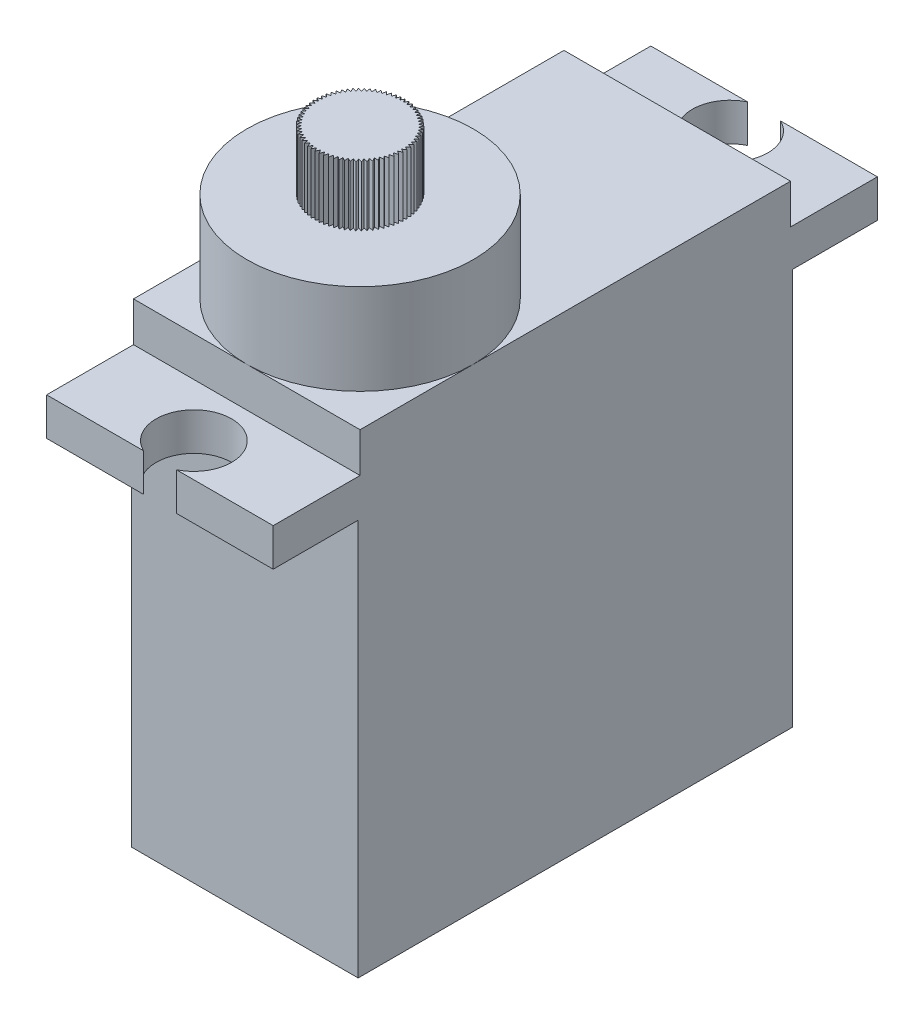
from build123d import *

# Parameters (mm, degrees)
SKETCH1_W           = 12
SKETCH1_H           = 23
BOSS_EXTRUDE1_DEPTH = 23
SKETCH3_W           = 12
SKETCH3_H           = 2
BOSS_EXTRUDE2_DEPTH = 4.5
SKETCH4_R           = 2
CUT_EXTRUDE1_DEPTH  = 29.653097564
SKETCH5_W           = 12
SKETCH5_H           = 22.8
BOSS_EXTRUDE3_DEPTH = 2.1
SKETCH6_R           = 6
BOSS_EXTRUDE4_DEPTH = 4.8
SKETCH7_R           = 2.4
BOSS_EXTRUDE5_DEPTH = 3.175
CUT_EXTRUDE2_DEPTH  = 3.175
CIRPATTERN1_COUNT   = 70


with BuildPart() as part:
    # Sketch1 → Boss-Extrude1 (new body)
    with BuildSketch(Plane(origin=(0, 0, 0), x_dir=(1, 0, 0), z_dir=(0, 1, 0))):
        Rectangle(SKETCH1_W, SKETCH1_H)
    extrude(amount=BOSS_EXTRUDE1_DEPTH)

    # Sketch3 → Boss-Extrude2 (add)
    with BuildSketch(Plane.XY.offset(11.5)):
        with Locations((0, 22)):
            Rectangle(SKETCH3_W, SKETCH3_H)
    boss_extrude2 = extrude(amount=BOSS_EXTRUDE2_DEPTH)

    # Sketch4 → Cut-Extrude1 (cut, through all)
    with BuildSketch(Plane(origin=(0, 23, 0), x_dir=(1, 0, 0), z_dir=(0, 1, 0))):
        with Locations((0, -14.2)):
            Circle(SKETCH4_R)
    cut_extrude1 = extrude(amount=-CUT_EXTRUDE1_DEPTH, mode=Mode.SUBTRACT)

    # Mirror1: Boss-Extrude2, Cut-Extrude1 across plane
    add(boss_extrude2.mirror(Plane.XY))
    add(cut_extrude1.mirror(Plane.XY), mode=Mode.SUBTRACT)

    # Sketch5 → Boss-Extrude3 (add)
    with BuildSketch(Plane(origin=(0, 23, 0), x_dir=(1, 0, 0), z_dir=(0, 1, 0))):
        Rectangle(SKETCH5_W, SKETCH5_H)
    extrude(amount=BOSS_EXTRUDE3_DEPTH)

    # Sketch6 → Boss-Extrude4 (add)
    with BuildSketch(Plane(origin=(0, 25.1, 0), x_dir=(1, 0, 0), z_dir=(0, 1, 0))):
        with Locations(Location((0, -5.4, 0), (0, 0, 270))):
            Circle(SKETCH6_R)
    extrude(amount=BOSS_EXTRUDE4_DEPTH)

    # Sketch7 → Boss-Extrude5 (add)
    with BuildSketch(Plane(origin=(0, 29.9, 0), x_dir=(1, 0, 0), z_dir=(0, 1, 0))):
        with Locations(Location((0, -5.4, 0), (0, 0, 270))):
            Circle(SKETCH7_R)
    extrude(amount=BOSS_EXTRUDE5_DEPTH)

    # Sketch8 → Cut-Extrude2 (cut)
    with BuildSketch(Plane(origin=(0, 33.075, 0), x_dir=(1, 0, 0), z_dir=(0, 1, 0))):
        Polygon((-2.2, -5.4), (-2.5, -5.226794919), (-2.5, -5.573205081), align=None)
    cut_extrude2 = extrude(amount=-CUT_EXTRUDE2_DEPTH, mode=Mode.SUBTRACT)

    # CirPattern1: Cut-Extrude2 ×70 about axis
    cirpattern1_axis = Axis((0, 0, 5.4), (0, 1, 0))
    for i in range(1, CIRPATTERN1_COUNT):
        add(cut_extrude2.rotate(cirpattern1_axis, i * 360 / CIRPATTERN1_COUNT), mode=Mode.SUBTRACT)


solid = part.part
